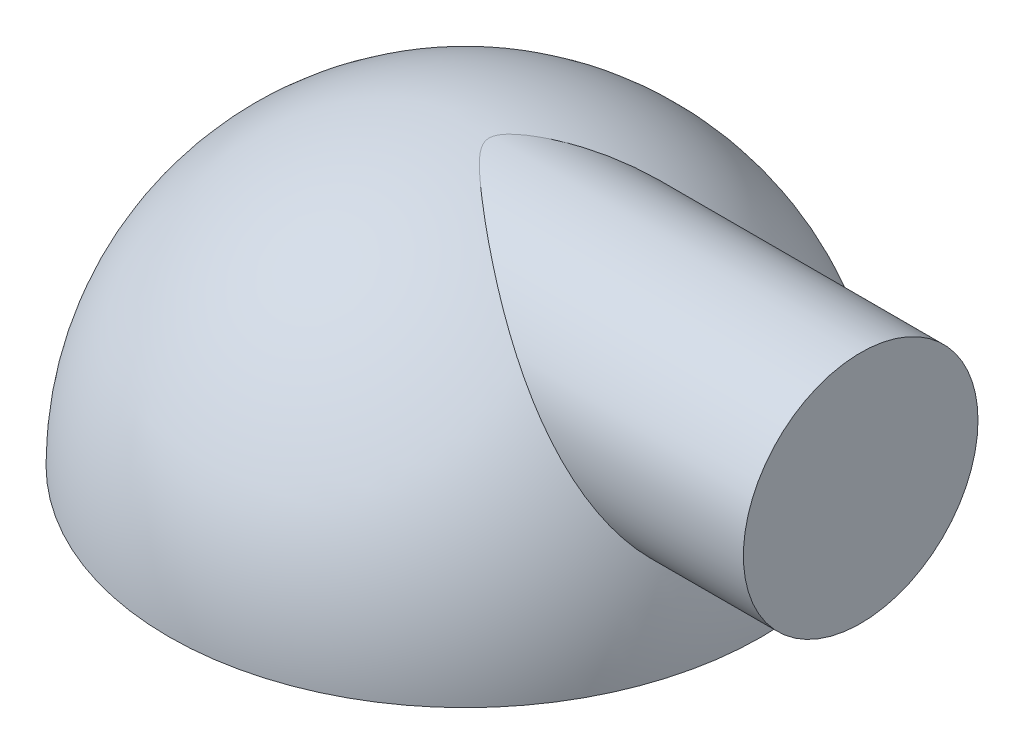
from build123d import *

# Parameters (mm, degrees)
SKETCH_2_R      = 11.869256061
EXTRUDE_1_DEPTH = 40


with BuildPart() as part:
    # Sketch 1 → Revolve 1 (revolve)
    with BuildSketch(Plane.XY):
        with BuildLine():
            Line((-30, 0), (0, 0))
            Line((0, 0), (0, 30))
            ThreePointArc((0, 30), (-21.213203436, 21.213203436), (-30, 0))
        make_face()
    revolve(axis=Axis((0, 0, 0), (0, 1, 0)))

    # Sketch 2 → Extrude 1 (add)
    with BuildSketch(Plane(origin=(0, 0, 0), x_dir=(0, 0, -1), z_dir=(1, 0, 0))):
        with Locations(Location((0, 18.034289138, 0), (0, 0, 72.478791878))):
            Circle(SKETCH_2_R)
    extrude(amount=EXTRUDE_1_DEPTH)


solid = part.part
